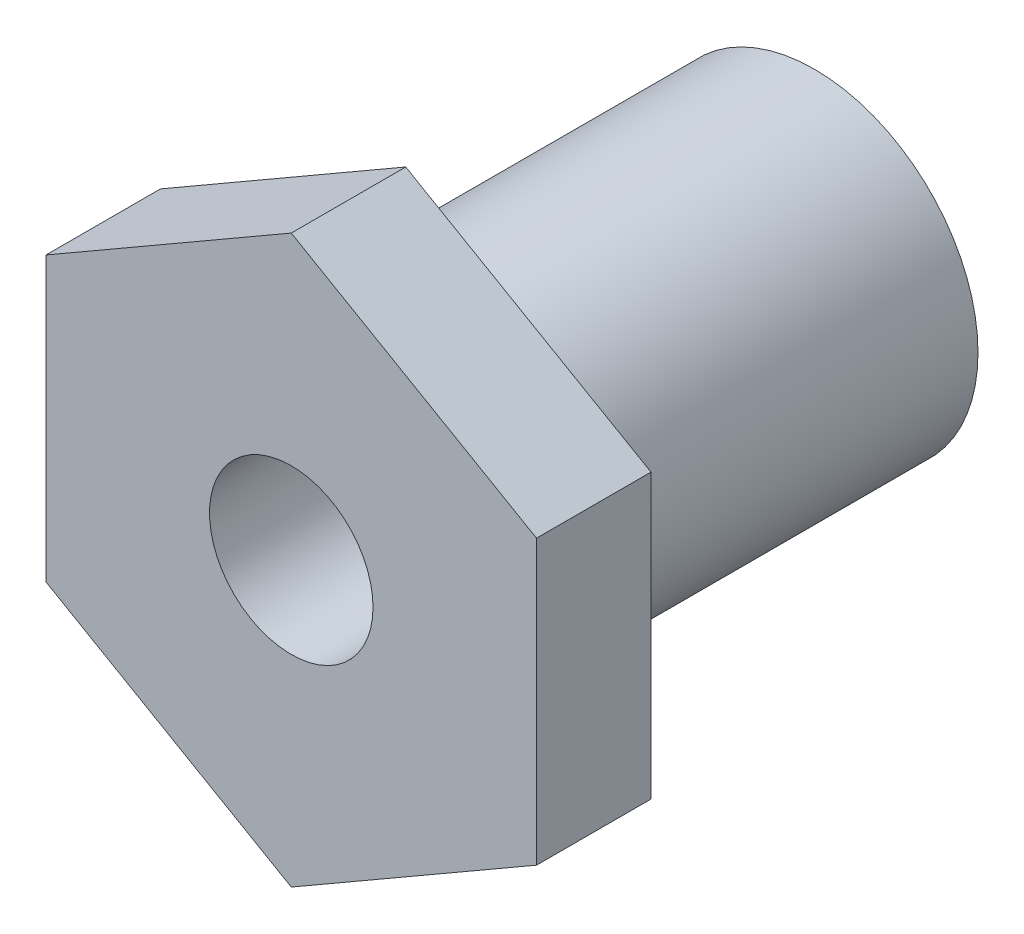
ISO-10303-21;
HEADER;
FILE_DESCRIPTION(('STEP AP214'),'2;1');
FILE_NAME('part.step','',(''),(''),'','','');
FILE_SCHEMA(('AUTOMOTIVE_DESIGN { 1 0 10303 214 1 1 1 1 }'));
ENDSEC;
DATA;
#1=APPLICATION_CONTEXT('core data for automotive mechanical design processes');
#2=APPLICATION_PROTOCOL_DEFINITION('international standard','automotive_design',2000,#1);
#3=PRODUCT_CONTEXT('',#1,'mechanical');
#4=PRODUCT('Part','Part','',(#3));
#5=PRODUCT_RELATED_PRODUCT_CATEGORY('part','',(#4));
#6=PRODUCT_DEFINITION_FORMATION('','',#4);
#7=PRODUCT_DEFINITION_CONTEXT('part definition',#1,'design');
#8=PRODUCT_DEFINITION('design','',#6,#7);
#9=PRODUCT_DEFINITION_SHAPE('','',#8);
#10=(LENGTH_UNIT() NAMED_UNIT(*) SI_UNIT(.MILLI.,.METRE.));
#11=(NAMED_UNIT(*) PLANE_ANGLE_UNIT() SI_UNIT($,.RADIAN.));
#12=(NAMED_UNIT(*) SI_UNIT($,.STERADIAN.) SOLID_ANGLE_UNIT());
#13=UNCERTAINTY_MEASURE_WITH_UNIT(LENGTH_MEASURE(1.E-05),#10,'distance_accuracy_value','');
#14=(GEOMETRIC_REPRESENTATION_CONTEXT(3) GLOBAL_UNCERTAINTY_ASSIGNED_CONTEXT((#13)) GLOBAL_UNIT_ASSIGNED_CONTEXT((#10,
#11,#12)) REPRESENTATION_CONTEXT('',''));
#15=CARTESIAN_POINT('',(0.,0.,0.));
#16=DIRECTION('',(0.,0.,1.));
#17=DIRECTION('',(1.,0.,0.));
#18=AXIS2_PLACEMENT_3D('',#15,#16,#17);
#19=CARTESIAN_POINT('',(0.,0.,-32.));
#20=DIRECTION('',(0.,0.,1.));
#21=DIRECTION('',(1.,0.,0.));
#22=AXIS2_PLACEMENT_3D('',#19,#20,#21);
#23=CYLINDRICAL_SURFACE('',#22,10.);
#24=CARTESIAN_POINT('',(0.,0.,-32.));
#25=DIRECTION('',(0.,0.,-1.));
#26=DIRECTION('',(-1.,0.,0.));
#27=AXIS2_PLACEMENT_3D('',#24,#25,#26);
#28=CIRCLE('',#27,10.);
#29=CARTESIAN_POINT('',(-10.,0.,-32.));
#30=VERTEX_POINT('',#29);
#31=EDGE_CURVE('E115',#30,#30,#28,.T.);
#32=ORIENTED_EDGE('',*,*,#31,.F.);
#33=EDGE_LOOP('',(#32));
#34=FACE_BOUND('',#33,.T.);
#35=CARTESIAN_POINT('',(0.,0.,-7.));
#36=DIRECTION('',(0.,0.,1.));
#37=DIRECTION('',(1.,0.,0.));
#38=AXIS2_PLACEMENT_3D('',#35,#36,#37);
#39=CIRCLE('',#38,10.);
#40=CARTESIAN_POINT('',(10.,0.,-7.));
#41=VERTEX_POINT('',#40);
#42=EDGE_CURVE('E9',#41,#41,#39,.F.);
#43=ORIENTED_EDGE('',*,*,#42,.T.);
#44=EDGE_LOOP('',(#43));
#45=FACE_BOUND('',#44,.T.);
#46=ADVANCED_FACE('F14',(#34,#45),#23,.T.);
#47=CARTESIAN_POINT('',(0.,0.,-32.));
#48=DIRECTION('',(0.,0.,-1.));
#49=DIRECTION('',(-1.,0.,0.));
#50=AXIS2_PLACEMENT_3D('',#47,#48,#49);
#51=PLANE('',#50);
#52=ORIENTED_EDGE('',*,*,#31,.T.);
#53=EDGE_LOOP('',(#52));
#54=FACE_BOUND('',#53,.T.);
#55=ADVANCED_FACE('F154',(#54),#51,.T.);
#56=CARTESIAN_POINT('',(-15.,8.66025403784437,-7.));
#57=DIRECTION('',(0.,0.,1.));
#58=DIRECTION('',(1.,0.,0.));
#59=AXIS2_PLACEMENT_3D('',#56,#57,#58);
#60=PLANE('',#59);
#61=DIRECTION('',(-0.86602540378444,-0.5,0.));
#62=VECTOR('',#61,1.);
#63=CARTESIAN_POINT('',(0.,17.3205080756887,-7.));
#64=LINE('',#63,#62);
#65=CARTESIAN_POINT('',(0.,17.3205080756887,-7.));
#66=VERTEX_POINT('',#65);
#67=CARTESIAN_POINT('',(-15.,8.66025403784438,-7.));
#68=VERTEX_POINT('',#67);
#69=EDGE_CURVE('E88',#66,#68,#64,.T.);
#70=ORIENTED_EDGE('',*,*,#69,.F.);
#71=DIRECTION('',(0.86602540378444,-0.5,0.));
#72=VECTOR('',#71,1.);
#73=CARTESIAN_POINT('',(0.,17.3205080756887,-7.));
#74=LINE('',#73,#72);
#75=CARTESIAN_POINT('',(15.,8.66025403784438,-7.));
#76=VERTEX_POINT('',#75);
#77=EDGE_CURVE('E83',#66,#76,#74,.T.);
#78=ORIENTED_EDGE('',*,*,#77,.T.);
#79=DIRECTION('',(0.,-1.,0.));
#80=VECTOR('',#79,1.);
#81=CARTESIAN_POINT('',(15.,8.66025403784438,-7.));
#82=LINE('',#81,#80);
#83=CARTESIAN_POINT('',(15.,-8.66025403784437,-7.));
#84=VERTEX_POINT('',#83);
#85=EDGE_CURVE('E81',#76,#84,#82,.T.);
#86=ORIENTED_EDGE('',*,*,#85,.T.);
#87=DIRECTION('',(0.86602540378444,0.5,0.));
#88=VECTOR('',#87,1.);
#89=CARTESIAN_POINT('',(0.,-17.3205080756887,-7.));
#90=LINE('',#89,#88);
#91=CARTESIAN_POINT('',(0.,-17.3205080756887,-7.));
#92=VERTEX_POINT('',#91);
#93=EDGE_CURVE('E57',#92,#84,#90,.T.);
#94=ORIENTED_EDGE('',*,*,#93,.F.);
#95=DIRECTION('',(-0.86602540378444,0.5,0.));
#96=VECTOR('',#95,1.);
#97=CARTESIAN_POINT('',(0.,-17.3205080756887,-7.));
#98=LINE('',#97,#96);
#99=CARTESIAN_POINT('',(-15.,-8.66025403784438,-7.));
#100=VERTEX_POINT('',#99);
#101=EDGE_CURVE('E69',#92,#100,#98,.T.);
#102=ORIENTED_EDGE('',*,*,#101,.T.);
#103=DIRECTION('',(0.,-1.,0.));
#104=VECTOR('',#103,1.);
#105=CARTESIAN_POINT('',(-15.,8.66025403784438,-7.));
#106=LINE('',#105,#104);
#107=EDGE_CURVE('E74',#68,#100,#106,.T.);
#108=ORIENTED_EDGE('',*,*,#107,.F.);
#109=EDGE_LOOP('',(#70,#78,#86,#94,#102,#108));
#110=FACE_BOUND('',#109,.T.);
#111=ORIENTED_EDGE('',*,*,#42,.F.);
#112=EDGE_LOOP('',(#111));
#113=FACE_BOUND('',#112,.T.);
#114=ADVANCED_FACE('F77',(#110,#113),#60,.F.);
#115=CARTESIAN_POINT('',(0.,17.3205080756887,-7.));
#116=DIRECTION('',(-0.5,0.86602540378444,0.));
#117=DIRECTION('',(-0.86602540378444,-0.5,0.));
#118=AXIS2_PLACEMENT_3D('',#115,#116,#117);
#119=PLANE('',#118);
#120=DIRECTION('',(0.,0.,1.));
#121=VECTOR('',#120,1.);
#122=CARTESIAN_POINT('',(0.,17.3205080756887,-7.));
#123=LINE('',#122,#121);
#124=CARTESIAN_POINT('',(0.,17.3205080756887,0.));
#125=VERTEX_POINT('',#124);
#126=EDGE_CURVE('E23',#66,#125,#123,.T.);
#127=ORIENTED_EDGE('',*,*,#126,.F.);
#128=ORIENTED_EDGE('',*,*,#69,.T.);
#129=DIRECTION('',(0.,0.,1.));
#130=VECTOR('',#129,1.);
#131=CARTESIAN_POINT('',(-15.,8.66025403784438,-7.));
#132=LINE('',#131,#130);
#133=CARTESIAN_POINT('',(-15.,8.66025403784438,0.));
#134=VERTEX_POINT('',#133);
#135=EDGE_CURVE('E30',#68,#134,#132,.T.);
#136=ORIENTED_EDGE('',*,*,#135,.T.);
#137=DIRECTION('',(-0.86602540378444,-0.5,0.));
#138=VECTOR('',#137,1.);
#139=CARTESIAN_POINT('',(0.,17.3205080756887,0.));
#140=LINE('',#139,#138);
#141=EDGE_CURVE('E105',#125,#134,#140,.T.);
#142=ORIENTED_EDGE('',*,*,#141,.F.);
#143=EDGE_LOOP('',(#127,#128,#136,#142));
#144=FACE_BOUND('',#143,.T.);
#145=ADVANCED_FACE('F106',(#144),#119,.T.);
#146=CARTESIAN_POINT('',(0.,17.3205080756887,-7.));
#147=DIRECTION('',(-0.5,-0.86602540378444,0.));
#148=DIRECTION('',(0.86602540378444,-0.5,0.));
#149=AXIS2_PLACEMENT_3D('',#146,#147,#148);
#150=PLANE('',#149);
#151=DIRECTION('',(0.,0.,1.));
#152=VECTOR('',#151,1.);
#153=CARTESIAN_POINT('',(15.,8.66025403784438,-7.));
#154=LINE('',#153,#152);
#155=CARTESIAN_POINT('',(15.,8.66025403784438,0.));
#156=VERTEX_POINT('',#155);
#157=EDGE_CURVE('E91',#76,#156,#154,.T.);
#158=ORIENTED_EDGE('',*,*,#157,.F.);
#159=ORIENTED_EDGE('',*,*,#77,.F.);
#160=ORIENTED_EDGE('',*,*,#126,.T.);
#161=DIRECTION('',(0.86602540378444,-0.5,0.));
#162=VECTOR('',#161,1.);
#163=CARTESIAN_POINT('',(0.,17.3205080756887,0.));
#164=LINE('',#163,#162);
#165=EDGE_CURVE('E101',#125,#156,#164,.T.);
#166=ORIENTED_EDGE('',*,*,#165,.T.);
#167=EDGE_LOOP('',(#158,#159,#160,#166));
#168=FACE_BOUND('',#167,.T.);
#169=ADVANCED_FACE('F16',(#168),#150,.F.);
#170=CARTESIAN_POINT('',(15.,8.66025403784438,-7.));
#171=DIRECTION('',(-1.,0.,0.));
#172=DIRECTION('',(0.,-1.,0.));
#173=AXIS2_PLACEMENT_3D('',#170,#171,#172);
#174=PLANE('',#173);
#175=DIRECTION('',(0.,0.,1.));
#176=VECTOR('',#175,1.);
#177=CARTESIAN_POINT('',(15.,-8.66025403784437,-7.));
#178=LINE('',#177,#176);
#179=CARTESIAN_POINT('',(15.,-8.66025403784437,0.));
#180=VERTEX_POINT('',#179);
#181=EDGE_CURVE('E65',#84,#180,#178,.T.);
#182=ORIENTED_EDGE('',*,*,#181,.F.);
#183=ORIENTED_EDGE('',*,*,#85,.F.);
#184=ORIENTED_EDGE('',*,*,#157,.T.);
#185=DIRECTION('',(0.,-1.,0.));
#186=VECTOR('',#185,1.);
#187=CARTESIAN_POINT('',(15.,8.66025403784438,0.));
#188=LINE('',#187,#186);
#189=EDGE_CURVE('E114',#156,#180,#188,.T.);
#190=ORIENTED_EDGE('',*,*,#189,.T.);
#191=EDGE_LOOP('',(#182,#183,#184,#190));
#192=FACE_BOUND('',#191,.T.);
#193=ADVANCED_FACE('F196',(#192),#174,.F.);
#194=CARTESIAN_POINT('',(0.,-17.3205080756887,-7.));
#195=DIRECTION('',(0.5,-0.86602540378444,0.));
#196=DIRECTION('',(0.86602540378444,0.5,0.));
#197=AXIS2_PLACEMENT_3D('',#194,#195,#196);
#198=PLANE('',#197);
#199=DIRECTION('',(0.,0.,1.));
#200=VECTOR('',#199,1.);
#201=CARTESIAN_POINT('',(0.,-17.3205080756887,-7.));
#202=LINE('',#201,#200);
#203=CARTESIAN_POINT('',(0.,-17.3205080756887,0.));
#204=VERTEX_POINT('',#203);
#205=EDGE_CURVE('E52',#92,#204,#202,.T.);
#206=ORIENTED_EDGE('',*,*,#205,.F.);
#207=ORIENTED_EDGE('',*,*,#93,.T.);
#208=ORIENTED_EDGE('',*,*,#181,.T.);
#209=DIRECTION('',(0.86602540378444,0.5,0.));
#210=VECTOR('',#209,1.);
#211=CARTESIAN_POINT('',(0.,-17.3205080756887,0.));
#212=LINE('',#211,#210);
#213=EDGE_CURVE('E61',#204,#180,#212,.T.);
#214=ORIENTED_EDGE('',*,*,#213,.F.);
#215=EDGE_LOOP('',(#206,#207,#208,#214));
#216=FACE_BOUND('',#215,.T.);
#217=ADVANCED_FACE('F54',(#216),#198,.T.);
#218=CARTESIAN_POINT('',(0.,-17.3205080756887,-7.));
#219=DIRECTION('',(0.5,0.86602540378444,0.));
#220=DIRECTION('',(-0.86602540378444,0.5,0.));
#221=AXIS2_PLACEMENT_3D('',#218,#219,#220);
#222=PLANE('',#221);
#223=DIRECTION('',(0.,0.,1.));
#224=VECTOR('',#223,1.);
#225=CARTESIAN_POINT('',(-15.,-8.66025403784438,-7.));
#226=LINE('',#225,#224);
#227=CARTESIAN_POINT('',(-15.,-8.66025403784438,0.));
#228=VERTEX_POINT('',#227);
#229=EDGE_CURVE('E66',#100,#228,#226,.T.);
#230=ORIENTED_EDGE('',*,*,#229,.F.);
#231=ORIENTED_EDGE('',*,*,#101,.F.);
#232=ORIENTED_EDGE('',*,*,#205,.T.);
#233=DIRECTION('',(-0.86602540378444,0.5,0.));
#234=VECTOR('',#233,1.);
#235=CARTESIAN_POINT('',(0.,-17.3205080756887,0.));
#236=LINE('',#235,#234);
#237=EDGE_CURVE('E123',#204,#228,#236,.T.);
#238=ORIENTED_EDGE('',*,*,#237,.T.);
#239=EDGE_LOOP('',(#230,#231,#232,#238));
#240=FACE_BOUND('',#239,.T.);
#241=ADVANCED_FACE('F70',(#240),#222,.F.);
#242=CARTESIAN_POINT('',(-15.,8.66025403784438,-7.));
#243=DIRECTION('',(-1.,0.,0.));
#244=DIRECTION('',(0.,0.,1.));
#245=AXIS2_PLACEMENT_3D('',#242,#243,#244);
#246=PLANE('',#245);
#247=ORIENTED_EDGE('',*,*,#107,.T.);
#248=ORIENTED_EDGE('',*,*,#229,.T.);
#249=DIRECTION('',(0.,-1.,0.));
#250=VECTOR('',#249,1.);
#251=CARTESIAN_POINT('',(-15.,8.66025403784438,0.));
#252=LINE('',#251,#250);
#253=EDGE_CURVE('E109',#134,#228,#252,.T.);
#254=ORIENTED_EDGE('',*,*,#253,.F.);
#255=ORIENTED_EDGE('',*,*,#135,.F.);
#256=EDGE_LOOP('',(#247,#248,#254,#255));
#257=FACE_BOUND('',#256,.T.);
#258=ADVANCED_FACE('F127',(#257),#246,.T.);
#259=CARTESIAN_POINT('',(-15.,8.66025403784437,0.));
#260=DIRECTION('',(0.,0.,1.));
#261=DIRECTION('',(1.,0.,0.));
#262=AXIS2_PLACEMENT_3D('',#259,#260,#261);
#263=PLANE('',#262);
#264=CARTESIAN_POINT('',(0.,0.,0.));
#265=DIRECTION('',(0.,0.,1.));
#266=DIRECTION('',(1.,0.,0.));
#267=AXIS2_PLACEMENT_3D('',#264,#265,#266);
#268=CIRCLE('',#267,5.);
#269=CARTESIAN_POINT('',(5.,0.,0.));
#270=VERTEX_POINT('',#269);
#271=EDGE_CURVE('E131',#270,#270,#268,.T.);
#272=ORIENTED_EDGE('',*,*,#271,.F.);
#273=EDGE_LOOP('',(#272));
#274=FACE_BOUND('',#273,.T.);
#275=ORIENTED_EDGE('',*,*,#141,.T.);
#276=ORIENTED_EDGE('',*,*,#253,.T.);
#277=ORIENTED_EDGE('',*,*,#237,.F.);
#278=ORIENTED_EDGE('',*,*,#213,.T.);
#279=ORIENTED_EDGE('',*,*,#189,.F.);
#280=ORIENTED_EDGE('',*,*,#165,.F.);
#281=EDGE_LOOP('',(#275,#276,#277,#278,#279,#280));
#282=FACE_BOUND('',#281,.T.);
#283=ADVANCED_FACE('F112',(#274,#282),#263,.T.);
#284=CARTESIAN_POINT('',(0.,0.,-12.));
#285=DIRECTION('',(0.,0.,1.));
#286=DIRECTION('',(1.,0.,0.));
#287=AXIS2_PLACEMENT_3D('',#284,#285,#286);
#288=CYLINDRICAL_SURFACE('',#287,5.);
#289=CARTESIAN_POINT('',(0.,0.,-12.));
#290=DIRECTION('',(0.,0.,1.));
#291=DIRECTION('',(1.,0.,0.));
#292=AXIS2_PLACEMENT_3D('',#289,#290,#291);
#293=CIRCLE('',#292,5.);
#294=CARTESIAN_POINT('',(5.,0.,-12.));
#295=VERTEX_POINT('',#294);
#296=EDGE_CURVE('E119',#295,#295,#293,.T.);
#297=ORIENTED_EDGE('',*,*,#296,.F.);
#298=EDGE_LOOP('',(#297));
#299=FACE_BOUND('',#298,.T.);
#300=ORIENTED_EDGE('',*,*,#271,.T.);
#301=EDGE_LOOP('',(#300));
#302=FACE_BOUND('',#301,.T.);
#303=ADVANCED_FACE('F135',(#299,#302),#288,.F.);
#304=CARTESIAN_POINT('',(0.,0.,-12.));
#305=DIRECTION('',(0.,0.,1.));
#306=DIRECTION('',(1.,0.,0.));
#307=AXIS2_PLACEMENT_3D('',#304,#305,#306);
#308=PLANE('',#307);
#309=ORIENTED_EDGE('',*,*,#296,.T.);
#310=EDGE_LOOP('',(#309));
#311=FACE_BOUND('',#310,.T.);
#312=ADVANCED_FACE('F139',(#311),#308,.T.);
#313=CLOSED_SHELL('',(#46,#55,#114,#145,#169,#193,#217,#241,#258,#283,#303,#312));
#314=MANIFOLD_SOLID_BREP('B1',#313);
#315=ADVANCED_BREP_SHAPE_REPRESENTATION('',(#18,#314),#14);
#316=SHAPE_DEFINITION_REPRESENTATION(#9,#315);
ENDSEC;
END-ISO-10303-21;
